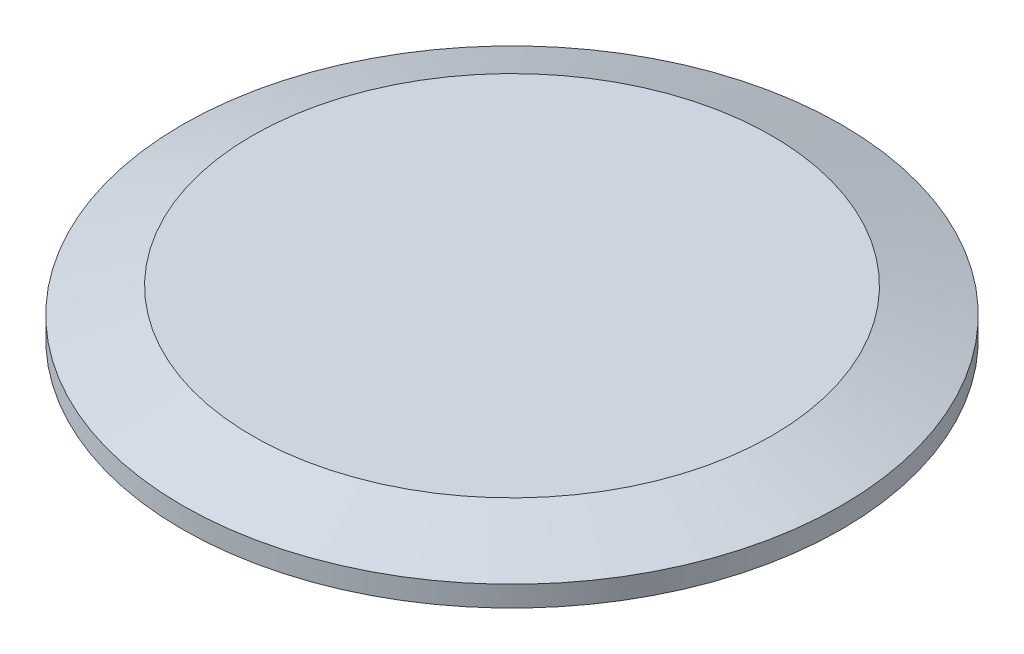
ISO-10303-21;
HEADER;
FILE_DESCRIPTION(('STEP AP214'),'2;1');
FILE_NAME('part.step','',(''),(''),'','','');
FILE_SCHEMA(('AUTOMOTIVE_DESIGN { 1 0 10303 214 1 1 1 1 }'));
ENDSEC;
DATA;
#1=APPLICATION_CONTEXT('core data for automotive mechanical design processes');
#2=APPLICATION_PROTOCOL_DEFINITION('international standard','automotive_design',2000,#1);
#3=PRODUCT_CONTEXT('',#1,'mechanical');
#4=PRODUCT('Part','Part','',(#3));
#5=PRODUCT_RELATED_PRODUCT_CATEGORY('part','',(#4));
#6=PRODUCT_DEFINITION_FORMATION('','',#4);
#7=PRODUCT_DEFINITION_CONTEXT('part definition',#1,'design');
#8=PRODUCT_DEFINITION('design','',#6,#7);
#9=PRODUCT_DEFINITION_SHAPE('','',#8);
#10=(LENGTH_UNIT() NAMED_UNIT(*) SI_UNIT(.MILLI.,.METRE.));
#11=(NAMED_UNIT(*) PLANE_ANGLE_UNIT() SI_UNIT($,.RADIAN.));
#12=(NAMED_UNIT(*) SI_UNIT($,.STERADIAN.) SOLID_ANGLE_UNIT());
#13=UNCERTAINTY_MEASURE_WITH_UNIT(LENGTH_MEASURE(1.E-05),#10,'distance_accuracy_value','');
#14=(GEOMETRIC_REPRESENTATION_CONTEXT(3) GLOBAL_UNCERTAINTY_ASSIGNED_CONTEXT((#13)) GLOBAL_UNIT_ASSIGNED_CONTEXT((#10,
#11,#12)) REPRESENTATION_CONTEXT('',''));
#15=CARTESIAN_POINT('',(0.,0.,0.));
#16=DIRECTION('',(0.,0.,1.));
#17=DIRECTION('',(1.,0.,0.));
#18=AXIS2_PLACEMENT_3D('',#15,#16,#17);
#19=CARTESIAN_POINT('',(-35.8228421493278,6.34999999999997,0.));
#20=DIRECTION('',(0.,1.,0.));
#21=DIRECTION('',(-1.,0.,0.));
#22=AXIS2_PLACEMENT_3D('',#19,#20,#21);
#23=PLANE('',#22);
#24=CARTESIAN_POINT('',(-1.73472347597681E-13,6.35000000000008,-1.87350135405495E-13));
#25=DIRECTION('',(0.,1.,0.));
#26=DIRECTION('',(-1.,0.,0.));
#27=AXIS2_PLACEMENT_3D('',#24,#25,#26);
#28=CIRCLE('',#27,35.8228421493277);
#29=CARTESIAN_POINT('',(-35.8228421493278,6.35000000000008,-1.87350135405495E-13));
#30=VERTEX_POINT('',#29);
#31=EDGE_CURVE('E10',#30,#30,#28,.T.);
#32=ORIENTED_EDGE('',*,*,#31,.T.);
#33=EDGE_LOOP('',(#32));
#34=FACE_BOUND('',#33,.T.);
#35=ADVANCED_FACE('F26',(#34),#23,.T.);
#36=CARTESIAN_POINT('',(-1.73472347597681E-13,6.35000000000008,-1.87350135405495E-13));
#37=DIRECTION('',(0.,-1.,0.));
#38=DIRECTION('',(1.,0.,0.));
#39=AXIS2_PLACEMENT_3D('',#36,#37,#38);
#40=CONICAL_SURFACE('',#39,35.8228421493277,1.22173047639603);
#41=CARTESIAN_POINT('',(0.,2.84479999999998,0.));
#42=DIRECTION('',(0.,1.,0.));
#43=DIRECTION('',(-1.,0.,0.));
#44=AXIS2_PLACEMENT_3D('',#41,#42,#43);
#45=CIRCLE('',#44,45.4533);
#46=CARTESIAN_POINT('',(-45.4533,2.84479999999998,0.));
#47=VERTEX_POINT('',#46);
#48=EDGE_CURVE('E32',#47,#47,#45,.T.);
#49=ORIENTED_EDGE('',*,*,#48,.T.);
#50=EDGE_LOOP('',(#49));
#51=FACE_BOUND('',#50,.T.);
#52=ORIENTED_EDGE('',*,*,#31,.F.);
#53=EDGE_LOOP('',(#52));
#54=FACE_BOUND('',#53,.T.);
#55=ADVANCED_FACE('F67',(#51,#54),#40,.T.);
#56=CARTESIAN_POINT('',(-1.73472347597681E-13,6.35000000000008,-1.87350135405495E-13));
#57=DIRECTION('',(0.,1.,0.));
#58=DIRECTION('',(-1.,0.,0.));
#59=AXIS2_PLACEMENT_3D('',#56,#57,#58);
#60=CYLINDRICAL_SURFACE('',#59,45.4533);
#61=CARTESIAN_POINT('',(0.,0.,0.));
#62=DIRECTION('',(0.,1.,0.));
#63=DIRECTION('',(-1.,0.,0.));
#64=AXIS2_PLACEMENT_3D('',#61,#62,#63);
#65=CIRCLE('',#64,45.4533);
#66=CARTESIAN_POINT('',(-45.4533,0.,0.));
#67=VERTEX_POINT('',#66);
#68=EDGE_CURVE('E36',#67,#67,#65,.T.);
#69=ORIENTED_EDGE('',*,*,#68,.T.);
#70=EDGE_LOOP('',(#69));
#71=FACE_BOUND('',#70,.T.);
#72=ORIENTED_EDGE('',*,*,#48,.F.);
#73=EDGE_LOOP('',(#72));
#74=FACE_BOUND('',#73,.T.);
#75=ADVANCED_FACE('F71',(#71,#74),#60,.T.);
#76=CARTESIAN_POINT('',(-43.4867084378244,0.,-1.73472347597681E-13));
#77=DIRECTION('',(0.,-1.,0.));
#78=DIRECTION('',(1.,0.,0.));
#79=AXIS2_PLACEMENT_3D('',#76,#77,#78);
#80=PLANE('',#79);
#81=CARTESIAN_POINT('',(0.,0.,0.));
#82=DIRECTION('',(0.,1.,0.));
#83=DIRECTION('',(-1.,0.,0.));
#84=AXIS2_PLACEMENT_3D('',#81,#82,#83);
#85=CIRCLE('',#84,43.4867084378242);
#86=CARTESIAN_POINT('',(-43.4867084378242,0.,0.));
#87=VERTEX_POINT('',#86);
#88=EDGE_CURVE('E40',#87,#87,#85,.T.);
#89=ORIENTED_EDGE('',*,*,#88,.T.);
#90=EDGE_LOOP('',(#89));
#91=FACE_BOUND('',#90,.T.);
#92=ORIENTED_EDGE('',*,*,#68,.F.);
#93=EDGE_LOOP('',(#92));
#94=FACE_BOUND('',#93,.T.);
#95=ADVANCED_FACE('F75',(#91,#94),#80,.T.);
#96=CARTESIAN_POINT('',(-2.32452945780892E-13,0.787399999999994,0.));
#97=DIRECTION('',(0.,1.,0.));
#98=DIRECTION('',(-1.,0.,0.));
#99=AXIS2_PLACEMENT_3D('',#96,#97,#98);
#100=TOROIDAL_SURFACE('',#99,43.4867084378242,0.787399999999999);
#101=CARTESIAN_POINT('',(-2.46330733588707E-13,0.474458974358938,-1.87350135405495E-13));
#102=DIRECTION('',(0.,1.,0.));
#103=DIRECTION('',(-1.,0.,0.));
#104=AXIS2_PLACEMENT_3D('',#101,#102,#103);
#105=CIRCLE('',#104,42.7641666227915);
#106=CARTESIAN_POINT('',(-42.7641666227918,0.474458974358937,-1.87350135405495E-13));
#107=VERTEX_POINT('',#106);
#108=EDGE_CURVE('E45',#107,#107,#105,.T.);
#109=ORIENTED_EDGE('',*,*,#108,.T.);
#110=EDGE_LOOP('',(#109));
#111=FACE_BOUND('',#110,.T.);
#112=ORIENTED_EDGE('',*,*,#88,.F.);
#113=EDGE_LOOP('',(#112));
#114=FACE_BOUND('',#113,.T.);
#115=ADVANCED_FACE('F82',(#111,#114),#100,.T.);
#116=CARTESIAN_POINT('',(0.,0.,0.));
#117=DIRECTION('',(0.,1.,0.));
#118=DIRECTION('',(-1.,0.,0.));
#119=AXIS2_PLACEMENT_3D('',#116,#117,#118);
#120=TOROIDAL_SURFACE('',#119,41.6687,1.19380000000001);
#121=CARTESIAN_POINT('',(-2.46330733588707E-13,0.474458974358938,-1.87350135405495E-13));
#122=DIRECTION('',(0.,1.,0.));
#123=DIRECTION('',(-1.,0.,0.));
#124=AXIS2_PLACEMENT_3D('',#121,#122,#123);
#125=CIRCLE('',#124,40.5732333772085);
#126=CARTESIAN_POINT('',(-40.5732333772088,0.474458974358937,-1.87350135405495E-13));
#127=VERTEX_POINT('',#126);
#128=EDGE_CURVE('E48',#127,#127,#125,.T.);
#129=ORIENTED_EDGE('',*,*,#128,.T.);
#130=EDGE_LOOP('',(#129));
#131=FACE_BOUND('',#130,.T.);
#132=ORIENTED_EDGE('',*,*,#108,.F.);
#133=EDGE_LOOP('',(#132));
#134=FACE_BOUND('',#133,.T.);
#135=ADVANCED_FACE('F64',(#131,#134),#120,.F.);
#136=CARTESIAN_POINT('',(-2.32452945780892E-13,0.787399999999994,0.));
#137=DIRECTION('',(0.,1.,0.));
#138=DIRECTION('',(-1.,0.,0.));
#139=AXIS2_PLACEMENT_3D('',#136,#137,#138);
#140=TOROIDAL_SURFACE('',#139,39.8506915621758,0.787399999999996);
#141=CARTESIAN_POINT('',(0.,0.,0.));
#142=DIRECTION('',(0.,1.,0.));
#143=DIRECTION('',(-1.,0.,0.));
#144=AXIS2_PLACEMENT_3D('',#141,#142,#143);
#145=CIRCLE('',#144,39.8506915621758);
#146=CARTESIAN_POINT('',(-39.8506915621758,0.,0.));
#147=VERTEX_POINT('',#146);
#148=EDGE_CURVE('E51',#147,#147,#145,.T.);
#149=ORIENTED_EDGE('',*,*,#148,.T.);
#150=EDGE_LOOP('',(#149));
#151=FACE_BOUND('',#150,.T.);
#152=ORIENTED_EDGE('',*,*,#128,.F.);
#153=EDGE_LOOP('',(#152));
#154=FACE_BOUND('',#153,.T.);
#155=ADVANCED_FACE('F55',(#151,#154),#140,.T.);
#156=CARTESIAN_POINT('',(0.,0.,0.));
#157=DIRECTION('',(0.,-1.,0.));
#158=DIRECTION('',(1.,0.,0.));
#159=AXIS2_PLACEMENT_3D('',#156,#157,#158);
#160=PLANE('',#159);
#161=ORIENTED_EDGE('',*,*,#148,.F.);
#162=EDGE_LOOP('',(#161));
#163=FACE_BOUND('',#162,.T.);
#164=ADVANCED_FACE('F58',(#163),#160,.T.);
#165=CLOSED_SHELL('',(#35,#55,#75,#95,#115,#135,#155,#164));
#166=MANIFOLD_SOLID_BREP('B2',#165);
#167=ADVANCED_BREP_SHAPE_REPRESENTATION('',(#18,#166),#14);
#168=SHAPE_DEFINITION_REPRESENTATION(#9,#167);
ENDSEC;
END-ISO-10303-21;
